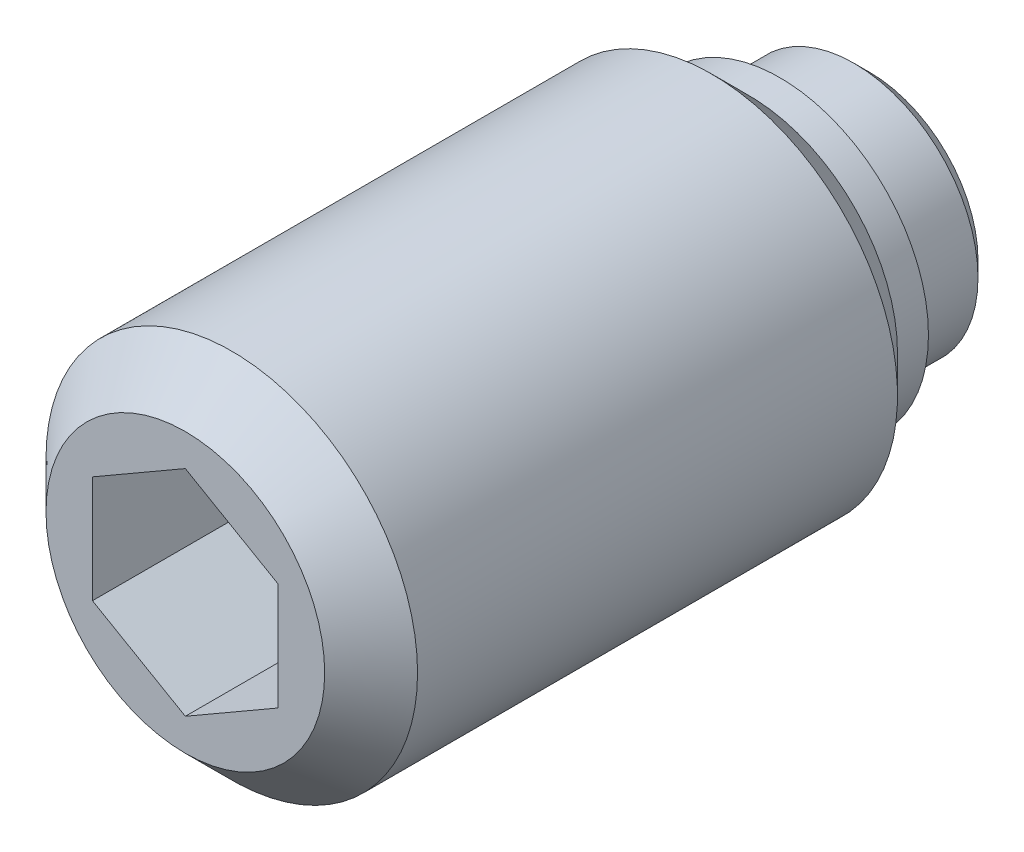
ISO-10303-21;
HEADER;
FILE_DESCRIPTION(('STEP AP214'),'2;1');
FILE_NAME('part.step','',(''),(''),'','','');
FILE_SCHEMA(('AUTOMOTIVE_DESIGN { 1 0 10303 214 1 1 1 1 }'));
ENDSEC;
DATA;
#1=APPLICATION_CONTEXT('core data for automotive mechanical design processes');
#2=APPLICATION_PROTOCOL_DEFINITION('international standard','automotive_design',2000,#1);
#3=PRODUCT_CONTEXT('',#1,'mechanical');
#4=PRODUCT('Part','Part','',(#3));
#5=PRODUCT_RELATED_PRODUCT_CATEGORY('part','',(#4));
#6=PRODUCT_DEFINITION_FORMATION('','',#4);
#7=PRODUCT_DEFINITION_CONTEXT('part definition',#1,'design');
#8=PRODUCT_DEFINITION('design','',#6,#7);
#9=PRODUCT_DEFINITION_SHAPE('','',#8);
#10=(LENGTH_UNIT() NAMED_UNIT(*) SI_UNIT(.MILLI.,.METRE.));
#11=(NAMED_UNIT(*) PLANE_ANGLE_UNIT() SI_UNIT($,.RADIAN.));
#12=(NAMED_UNIT(*) SI_UNIT($,.STERADIAN.) SOLID_ANGLE_UNIT());
#13=UNCERTAINTY_MEASURE_WITH_UNIT(LENGTH_MEASURE(1.E-05),#10,'distance_accuracy_value','');
#14=(GEOMETRIC_REPRESENTATION_CONTEXT(3) GLOBAL_UNCERTAINTY_ASSIGNED_CONTEXT((#13)) GLOBAL_UNIT_ASSIGNED_CONTEXT((#10,
#11,#12)) REPRESENTATION_CONTEXT('',''));
#15=CARTESIAN_POINT('',(0.,0.,0.));
#16=DIRECTION('',(0.,0.,1.));
#17=DIRECTION('',(1.,0.,0.));
#18=AXIS2_PLACEMENT_3D('',#15,#16,#17);
#19=CARTESIAN_POINT('',(0.,0.,0.));
#20=DIRECTION('',(0.,0.,-1.));
#21=DIRECTION('',(-1.,0.,0.));
#22=AXIS2_PLACEMENT_3D('',#19,#20,#21);
#23=CYLINDRICAL_SURFACE('',#22,4.);
#24=CARTESIAN_POINT('',(0.,0.,0.5));
#25=DIRECTION('',(0.,0.,-1.));
#26=DIRECTION('',(-1.,0.,0.));
#27=AXIS2_PLACEMENT_3D('',#24,#25,#26);
#28=CIRCLE('',#27,4.);
#29=CARTESIAN_POINT('',(-4.,0.,0.5));
#30=VERTEX_POINT('',#29);
#31=EDGE_CURVE('E133',#30,#30,#28,.T.);
#32=ORIENTED_EDGE('',*,*,#31,.F.);
#33=EDGE_LOOP('',(#32));
#34=FACE_BOUND('',#33,.T.);
#35=CARTESIAN_POINT('',(0.,0.,2.9));
#36=DIRECTION('',(0.,0.,-1.));
#37=DIRECTION('',(-1.,0.,0.));
#38=AXIS2_PLACEMENT_3D('',#35,#36,#37);
#39=CIRCLE('',#38,4.);
#40=CARTESIAN_POINT('',(-4.,0.,2.9));
#41=VERTEX_POINT('',#40);
#42=EDGE_CURVE('E127',#41,#41,#39,.T.);
#43=ORIENTED_EDGE('',*,*,#42,.T.);
#44=EDGE_LOOP('',(#43));
#45=FACE_BOUND('',#44,.T.);
#46=ADVANCED_FACE('F14',(#34,#45),#23,.T.);
#47=CARTESIAN_POINT('',(0.,0.,0.5));
#48=DIRECTION('',(0.,0.,1.));
#49=DIRECTION('',(1.,0.,0.));
#50=AXIS2_PLACEMENT_3D('',#47,#48,#49);
#51=CONICAL_SURFACE('',#50,4.,0.785398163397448);
#52=CARTESIAN_POINT('',(0.,0.,0.));
#53=DIRECTION('',(0.,0.,-1.));
#54=DIRECTION('',(-1.,0.,0.));
#55=AXIS2_PLACEMENT_3D('',#52,#53,#54);
#56=CIRCLE('',#55,3.5);
#57=CARTESIAN_POINT('',(-3.5,0.,0.));
#58=VERTEX_POINT('',#57);
#59=EDGE_CURVE('E130',#58,#58,#56,.T.);
#60=ORIENTED_EDGE('',*,*,#59,.F.);
#61=EDGE_LOOP('',(#60));
#62=FACE_BOUND('',#61,.T.);
#63=ORIENTED_EDGE('',*,*,#31,.T.);
#64=EDGE_LOOP('',(#63));
#65=FACE_BOUND('',#64,.T.);
#66=ADVANCED_FACE('F159',(#62,#65),#51,.T.);
#67=CARTESIAN_POINT('',(0.,3.5,0.));
#68=DIRECTION('',(0.,0.,1.));
#69=DIRECTION('',(1.,0.,0.));
#70=AXIS2_PLACEMENT_3D('',#67,#68,#69);
#71=PLANE('',#70);
#72=ORIENTED_EDGE('',*,*,#59,.T.);
#73=EDGE_LOOP('',(#72));
#74=FACE_BOUND('',#73,.T.);
#75=ADVANCED_FACE('F165',(#74),#71,.F.);
#76=CARTESIAN_POINT('',(0.,0.,2.9));
#77=DIRECTION('',(0.,0.,-1.));
#78=DIRECTION('',(-1.,0.,0.));
#79=AXIS2_PLACEMENT_3D('',#76,#77,#78);
#80=CYLINDRICAL_SURFACE('',#79,6.);
#81=CARTESIAN_POINT('',(0.,0.,5.1));
#82=DIRECTION('',(0.,0.,-1.));
#83=DIRECTION('',(-1.,0.,0.));
#84=AXIS2_PLACEMENT_3D('',#81,#82,#83);
#85=CIRCLE('',#84,6.);
#86=CARTESIAN_POINT('',(-6.,0.,5.1));
#87=VERTEX_POINT('',#86);
#88=EDGE_CURVE('E9',#87,#87,#85,.T.);
#89=ORIENTED_EDGE('',*,*,#88,.F.);
#90=EDGE_LOOP('',(#89));
#91=FACE_BOUND('',#90,.T.);
#92=CARTESIAN_POINT('',(0.,0.,20.6));
#93=DIRECTION('',(0.,0.,1.));
#94=DIRECTION('',(1.,0.,0.));
#95=AXIS2_PLACEMENT_3D('',#92,#93,#94);
#96=CIRCLE('',#95,6.);
#97=CARTESIAN_POINT('',(6.,0.,20.6));
#98=VERTEX_POINT('',#97);
#99=EDGE_CURVE('E124',#98,#98,#96,.T.);
#100=ORIENTED_EDGE('',*,*,#99,.F.);
#101=EDGE_LOOP('',(#100));
#102=FACE_BOUND('',#101,.T.);
#103=ADVANCED_FACE('F16',(#91,#102),#80,.T.);
#104=CARTESIAN_POINT('',(0.,4.8,2.9));
#105=DIRECTION('',(0.,0.,1.));
#106=DIRECTION('',(1.,0.,0.));
#107=AXIS2_PLACEMENT_3D('',#104,#105,#106);
#108=PLANE('',#107);
#109=CARTESIAN_POINT('',(0.,0.,2.9));
#110=DIRECTION('',(0.,0.,-1.));
#111=DIRECTION('',(-1.,0.,0.));
#112=AXIS2_PLACEMENT_3D('',#109,#110,#111);
#113=CIRCLE('',#112,4.8);
#114=CARTESIAN_POINT('',(-4.8,0.,2.9));
#115=VERTEX_POINT('',#114);
#116=EDGE_CURVE('E136',#115,#115,#113,.T.);
#117=ORIENTED_EDGE('',*,*,#116,.T.);
#118=EDGE_LOOP('',(#117));
#119=FACE_BOUND('',#118,.T.);
#120=ORIENTED_EDGE('',*,*,#42,.F.);
#121=EDGE_LOOP('',(#120));
#122=FACE_BOUND('',#121,.T.);
#123=ADVANCED_FACE('F156',(#119,#122),#108,.F.);
#124=CARTESIAN_POINT('',(0.,0.,2.9));
#125=DIRECTION('',(0.,0.,-1.));
#126=DIRECTION('',(-1.,0.,0.));
#127=AXIS2_PLACEMENT_3D('',#124,#125,#126);
#128=CYLINDRICAL_SURFACE('',#127,4.8);
#129=CARTESIAN_POINT('',(0.,0.,3.9));
#130=DIRECTION('',(0.,0.,-1.));
#131=DIRECTION('',(-1.,0.,0.));
#132=AXIS2_PLACEMENT_3D('',#129,#130,#131);
#133=CIRCLE('',#132,4.8);
#134=CARTESIAN_POINT('',(-4.8,0.,3.9));
#135=VERTEX_POINT('',#134);
#136=EDGE_CURVE('E22',#135,#135,#133,.T.);
#137=ORIENTED_EDGE('',*,*,#136,.T.);
#138=EDGE_LOOP('',(#137));
#139=FACE_BOUND('',#138,.T.);
#140=ORIENTED_EDGE('',*,*,#116,.F.);
#141=EDGE_LOOP('',(#140));
#142=FACE_BOUND('',#141,.T.);
#143=ADVANCED_FACE('F141',(#139,#142),#128,.T.);
#144=CARTESIAN_POINT('',(0.,0.,5.1));
#145=DIRECTION('',(0.,0.,1.));
#146=DIRECTION('',(1.,0.,0.));
#147=AXIS2_PLACEMENT_3D('',#144,#145,#146);
#148=CONICAL_SURFACE('',#147,6.,0.785398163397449);
#149=ORIENTED_EDGE('',*,*,#88,.T.);
#150=EDGE_LOOP('',(#149));
#151=FACE_BOUND('',#150,.T.);
#152=ORIENTED_EDGE('',*,*,#136,.F.);
#153=EDGE_LOOP('',(#152));
#154=FACE_BOUND('',#153,.T.);
#155=ADVANCED_FACE('F144',(#151,#154),#148,.T.);
#156=CARTESIAN_POINT('',(0.,-4.5,22.1));
#157=DIRECTION('',(0.,0.,1.));
#158=DIRECTION('',(1.,0.,0.));
#159=AXIS2_PLACEMENT_3D('',#156,#157,#158);
#160=PLANE('',#159);
#161=DIRECTION('',(0.866025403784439,-0.5,0.));
#162=VECTOR('',#161,1.);
#163=CARTESIAN_POINT('',(-3.,-1.73205080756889,22.1));
#164=LINE('',#163,#162);
#165=CARTESIAN_POINT('',(-3.,-1.73205080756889,22.1));
#166=VERTEX_POINT('',#165);
#167=CARTESIAN_POINT('',(0.,-3.46410161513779,22.1));
#168=VERTEX_POINT('',#167);
#169=EDGE_CURVE('E29',#166,#168,#164,.T.);
#170=ORIENTED_EDGE('',*,*,#169,.F.);
#171=DIRECTION('',(0.,-1.,0.));
#172=VECTOR('',#171,1.);
#173=CARTESIAN_POINT('',(-3.,1.73205080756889,22.1));
#174=LINE('',#173,#172);
#175=CARTESIAN_POINT('',(-3.,1.73205080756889,22.1));
#176=VERTEX_POINT('',#175);
#177=EDGE_CURVE('E112',#176,#166,#174,.T.);
#178=ORIENTED_EDGE('',*,*,#177,.F.);
#179=DIRECTION('',(-0.866025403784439,-0.5,0.));
#180=VECTOR('',#179,1.);
#181=CARTESIAN_POINT('',(0.,3.46410161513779,22.1));
#182=LINE('',#181,#180);
#183=CARTESIAN_POINT('',(0.,3.46410161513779,22.1));
#184=VERTEX_POINT('',#183);
#185=EDGE_CURVE('E110',#184,#176,#182,.T.);
#186=ORIENTED_EDGE('',*,*,#185,.F.);
#187=DIRECTION('',(-0.866025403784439,0.5,0.));
#188=VECTOR('',#187,1.);
#189=CARTESIAN_POINT('',(3.,1.73205080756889,22.1));
#190=LINE('',#189,#188);
#191=CARTESIAN_POINT('',(3.,1.73205080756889,22.1));
#192=VERTEX_POINT('',#191);
#193=EDGE_CURVE('E77',#192,#184,#190,.T.);
#194=ORIENTED_EDGE('',*,*,#193,.F.);
#195=DIRECTION('',(0.,1.,0.));
#196=VECTOR('',#195,1.);
#197=CARTESIAN_POINT('',(3.,-1.73205080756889,22.1));
#198=LINE('',#197,#196);
#199=CARTESIAN_POINT('',(3.,-1.73205080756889,22.1));
#200=VERTEX_POINT('',#199);
#201=EDGE_CURVE('E106',#200,#192,#198,.T.);
#202=ORIENTED_EDGE('',*,*,#201,.F.);
#203=DIRECTION('',(0.866025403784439,0.5,0.));
#204=VECTOR('',#203,1.);
#205=CARTESIAN_POINT('',(0.,-3.46410161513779,22.1));
#206=LINE('',#205,#204);
#207=EDGE_CURVE('E103',#168,#200,#206,.T.);
#208=ORIENTED_EDGE('',*,*,#207,.F.);
#209=EDGE_LOOP('',(#170,#178,#186,#194,#202,#208));
#210=FACE_BOUND('',#209,.T.);
#211=CARTESIAN_POINT('',(0.,0.,22.1));
#212=DIRECTION('',(0.,0.,1.));
#213=DIRECTION('',(1.,0.,0.));
#214=AXIS2_PLACEMENT_3D('',#211,#212,#213);
#215=CIRCLE('',#214,4.5);
#216=CARTESIAN_POINT('',(4.5,0.,22.1));
#217=VERTEX_POINT('',#216);
#218=EDGE_CURVE('E116',#217,#217,#215,.T.);
#219=ORIENTED_EDGE('',*,*,#218,.T.);
#220=EDGE_LOOP('',(#219));
#221=FACE_BOUND('',#220,.T.);
#222=ADVANCED_FACE('F146',(#210,#221),#160,.T.);
#223=CARTESIAN_POINT('',(0.,0.,22.1));
#224=DIRECTION('',(0.,0.,-1.));
#225=DIRECTION('',(-1.,0.,0.));
#226=AXIS2_PLACEMENT_3D('',#223,#224,#225);
#227=CONICAL_SURFACE('',#226,4.5,0.785398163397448);
#228=ORIENTED_EDGE('',*,*,#99,.T.);
#229=EDGE_LOOP('',(#228));
#230=FACE_BOUND('',#229,.T.);
#231=ORIENTED_EDGE('',*,*,#218,.F.);
#232=EDGE_LOOP('',(#231));
#233=FACE_BOUND('',#232,.T.);
#234=ADVANCED_FACE('F153',(#230,#233),#227,.T.);
#235=CARTESIAN_POINT('',(-3.,-1.73205080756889,14.1));
#236=DIRECTION('',(-0.5,-0.866025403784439,0.));
#237=DIRECTION('',(0.866025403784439,-0.5,0.));
#238=AXIS2_PLACEMENT_3D('',#235,#236,#237);
#239=PLANE('',#238);
#240=ORIENTED_EDGE('',*,*,#169,.T.);
#241=DIRECTION('',(0.,0.,1.));
#242=VECTOR('',#241,1.);
#243=CARTESIAN_POINT('',(0.,-3.46410161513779,14.1));
#244=LINE('',#243,#242);
#245=CARTESIAN_POINT('',(0.,-3.46410161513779,14.1));
#246=VERTEX_POINT('',#245);
#247=EDGE_CURVE('E59',#246,#168,#244,.T.);
#248=ORIENTED_EDGE('',*,*,#247,.F.);
#249=DIRECTION('',(0.866025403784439,-0.5,0.));
#250=VECTOR('',#249,1.);
#251=CARTESIAN_POINT('',(-3.,-1.73205080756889,14.1));
#252=LINE('',#251,#250);
#253=CARTESIAN_POINT('',(-3.,-1.73205080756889,14.1));
#254=VERTEX_POINT('',#253);
#255=EDGE_CURVE('E114',#254,#246,#252,.T.);
#256=ORIENTED_EDGE('',*,*,#255,.F.);
#257=DIRECTION('',(0.,0.,1.));
#258=VECTOR('',#257,1.);
#259=CARTESIAN_POINT('',(-3.,-1.73205080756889,14.1));
#260=LINE('',#259,#258);
#261=EDGE_CURVE('E37',#254,#166,#260,.T.);
#262=ORIENTED_EDGE('',*,*,#261,.T.);
#263=EDGE_LOOP('',(#240,#248,#256,#262));
#264=FACE_BOUND('',#263,.T.);
#265=ADVANCED_FACE('F191',(#264),#239,.F.);
#266=CARTESIAN_POINT('',(-3.,1.73205080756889,14.1));
#267=DIRECTION('',(-1.,0.,0.));
#268=DIRECTION('',(0.,0.,1.));
#269=AXIS2_PLACEMENT_3D('',#266,#267,#268);
#270=PLANE('',#269);
#271=ORIENTED_EDGE('',*,*,#177,.T.);
#272=ORIENTED_EDGE('',*,*,#261,.F.);
#273=DIRECTION('',(0.,-1.,0.));
#274=VECTOR('',#273,1.);
#275=CARTESIAN_POINT('',(-3.,1.73205080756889,14.1));
#276=LINE('',#275,#274);
#277=CARTESIAN_POINT('',(-3.,1.73205080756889,14.1));
#278=VERTEX_POINT('',#277);
#279=EDGE_CURVE('E89',#278,#254,#276,.T.);
#280=ORIENTED_EDGE('',*,*,#279,.F.);
#281=DIRECTION('',(0.,0.,1.));
#282=VECTOR('',#281,1.);
#283=CARTESIAN_POINT('',(-3.,1.73205080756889,14.1));
#284=LINE('',#283,#282);
#285=EDGE_CURVE('E81',#278,#176,#284,.T.);
#286=ORIENTED_EDGE('',*,*,#285,.T.);
#287=EDGE_LOOP('',(#271,#272,#280,#286));
#288=FACE_BOUND('',#287,.T.);
#289=ADVANCED_FACE('F198',(#288),#270,.F.);
#290=CARTESIAN_POINT('',(0.,3.46410161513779,14.1));
#291=DIRECTION('',(-0.5,0.866025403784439,0.));
#292=DIRECTION('',(-0.866025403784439,-0.5,0.));
#293=AXIS2_PLACEMENT_3D('',#290,#291,#292);
#294=PLANE('',#293);
#295=ORIENTED_EDGE('',*,*,#185,.T.);
#296=ORIENTED_EDGE('',*,*,#285,.F.);
#297=DIRECTION('',(-0.866025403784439,-0.5,0.));
#298=VECTOR('',#297,1.);
#299=CARTESIAN_POINT('',(0.,3.46410161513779,14.1));
#300=LINE('',#299,#298);
#301=CARTESIAN_POINT('',(0.,3.46410161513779,14.1));
#302=VERTEX_POINT('',#301);
#303=EDGE_CURVE('E85',#302,#278,#300,.T.);
#304=ORIENTED_EDGE('',*,*,#303,.F.);
#305=DIRECTION('',(0.,0.,1.));
#306=VECTOR('',#305,1.);
#307=CARTESIAN_POINT('',(0.,3.46410161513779,14.1));
#308=LINE('',#307,#306);
#309=EDGE_CURVE('E70',#302,#184,#308,.T.);
#310=ORIENTED_EDGE('',*,*,#309,.T.);
#311=EDGE_LOOP('',(#295,#296,#304,#310));
#312=FACE_BOUND('',#311,.T.);
#313=ADVANCED_FACE('F86',(#312),#294,.F.);
#314=CARTESIAN_POINT('',(3.,1.73205080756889,14.1));
#315=DIRECTION('',(0.5,0.866025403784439,0.));
#316=DIRECTION('',(-0.866025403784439,0.5,0.));
#317=AXIS2_PLACEMENT_3D('',#314,#315,#316);
#318=PLANE('',#317);
#319=ORIENTED_EDGE('',*,*,#193,.T.);
#320=ORIENTED_EDGE('',*,*,#309,.F.);
#321=DIRECTION('',(-0.866025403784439,0.5,0.));
#322=VECTOR('',#321,1.);
#323=CARTESIAN_POINT('',(3.,1.73205080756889,14.1));
#324=LINE('',#323,#322);
#325=CARTESIAN_POINT('',(3.,1.73205080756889,14.1));
#326=VERTEX_POINT('',#325);
#327=EDGE_CURVE('E74',#326,#302,#324,.T.);
#328=ORIENTED_EDGE('',*,*,#327,.F.);
#329=DIRECTION('',(0.,0.,1.));
#330=VECTOR('',#329,1.);
#331=CARTESIAN_POINT('',(3.,1.73205080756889,14.1));
#332=LINE('',#331,#330);
#333=EDGE_CURVE('E82',#326,#192,#332,.T.);
#334=ORIENTED_EDGE('',*,*,#333,.T.);
#335=EDGE_LOOP('',(#319,#320,#328,#334));
#336=FACE_BOUND('',#335,.T.);
#337=ADVANCED_FACE('F72',(#336),#318,.F.);
#338=CARTESIAN_POINT('',(3.,-1.73205080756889,14.1));
#339=DIRECTION('',(1.,0.,0.));
#340=DIRECTION('',(0.,0.,-1.));
#341=AXIS2_PLACEMENT_3D('',#338,#339,#340);
#342=PLANE('',#341);
#343=ORIENTED_EDGE('',*,*,#201,.T.);
#344=ORIENTED_EDGE('',*,*,#333,.F.);
#345=DIRECTION('',(0.,1.,0.));
#346=VECTOR('',#345,1.);
#347=CARTESIAN_POINT('',(3.,-1.73205080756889,14.1));
#348=LINE('',#347,#346);
#349=CARTESIAN_POINT('',(3.,-1.73205080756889,14.1));
#350=VERTEX_POINT('',#349);
#351=EDGE_CURVE('E95',#350,#326,#348,.T.);
#352=ORIENTED_EDGE('',*,*,#351,.F.);
#353=DIRECTION('',(0.,0.,1.));
#354=VECTOR('',#353,1.);
#355=CARTESIAN_POINT('',(3.,-1.73205080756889,14.1));
#356=LINE('',#355,#354);
#357=EDGE_CURVE('E119',#350,#200,#356,.T.);
#358=ORIENTED_EDGE('',*,*,#357,.T.);
#359=EDGE_LOOP('',(#343,#344,#352,#358));
#360=FACE_BOUND('',#359,.T.);
#361=ADVANCED_FACE('F204',(#360),#342,.F.);
#362=CARTESIAN_POINT('',(0.,-3.46410161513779,14.1));
#363=DIRECTION('',(0.5,-0.866025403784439,0.));
#364=DIRECTION('',(0.866025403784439,0.5,0.));
#365=AXIS2_PLACEMENT_3D('',#362,#363,#364);
#366=PLANE('',#365);
#367=ORIENTED_EDGE('',*,*,#207,.T.);
#368=ORIENTED_EDGE('',*,*,#357,.F.);
#369=DIRECTION('',(0.866025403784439,0.5,0.));
#370=VECTOR('',#369,1.);
#371=CARTESIAN_POINT('',(0.,-3.46410161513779,14.1));
#372=LINE('',#371,#370);
#373=EDGE_CURVE('E97',#246,#350,#372,.T.);
#374=ORIENTED_EDGE('',*,*,#373,.F.);
#375=ORIENTED_EDGE('',*,*,#247,.T.);
#376=EDGE_LOOP('',(#367,#368,#374,#375));
#377=FACE_BOUND('',#376,.T.);
#378=ADVANCED_FACE('F201',(#377),#366,.F.);
#379=CARTESIAN_POINT('',(0.,0.,14.1));
#380=DIRECTION('',(0.,0.,1.));
#381=DIRECTION('',(1.,0.,0.));
#382=AXIS2_PLACEMENT_3D('',#379,#380,#381);
#383=PLANE('',#382);
#384=ORIENTED_EDGE('',*,*,#255,.T.);
#385=ORIENTED_EDGE('',*,*,#373,.T.);
#386=ORIENTED_EDGE('',*,*,#351,.T.);
#387=ORIENTED_EDGE('',*,*,#327,.T.);
#388=ORIENTED_EDGE('',*,*,#303,.T.);
#389=ORIENTED_EDGE('',*,*,#279,.T.);
#390=EDGE_LOOP('',(#384,#385,#386,#387,#388,#389));
#391=FACE_BOUND('',#390,.T.);
#392=ADVANCED_FACE('F92',(#391),#383,.T.);
#393=CLOSED_SHELL('',(#46,#66,#75,#103,#123,#143,#155,#222,#234,#265,#289,#313,#337,#361,#378,#392));
#394=MANIFOLD_SOLID_BREP('B1',#393);
#395=ADVANCED_BREP_SHAPE_REPRESENTATION('',(#18,#394),#14);
#396=SHAPE_DEFINITION_REPRESENTATION(#9,#395);
ENDSEC;
END-ISO-10303-21;
